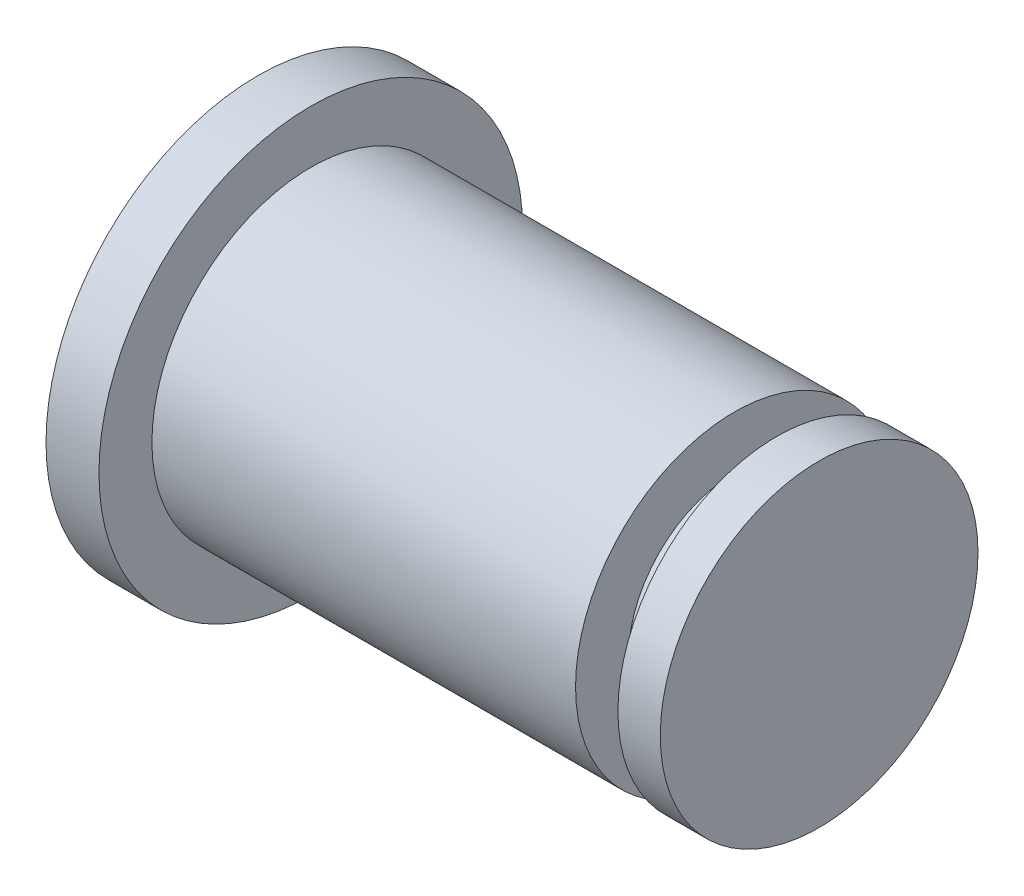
from build123d import *


with BuildPart() as part:
    # Esquisse1 → Base-R_volution (revolve)
    with BuildSketch(Plane.XY, mode=Mode.PRIVATE) as base_r_volution_sk:
        Polygon((0, 0), (0, 4), (1, 4), (1, 3), (9, 3), (9, 2), (9.8, 2), (9.8, 3), (10.6, 3), (10.6, 0), align=None)
    revolve(base_r_volution_sk.sketch.rotate(Axis((-44.793997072, 0, 0), (1, 0, 0)), 90), axis=Axis((-44.793997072, 0, 0), (1, 0, 0)))


solid = part.part
